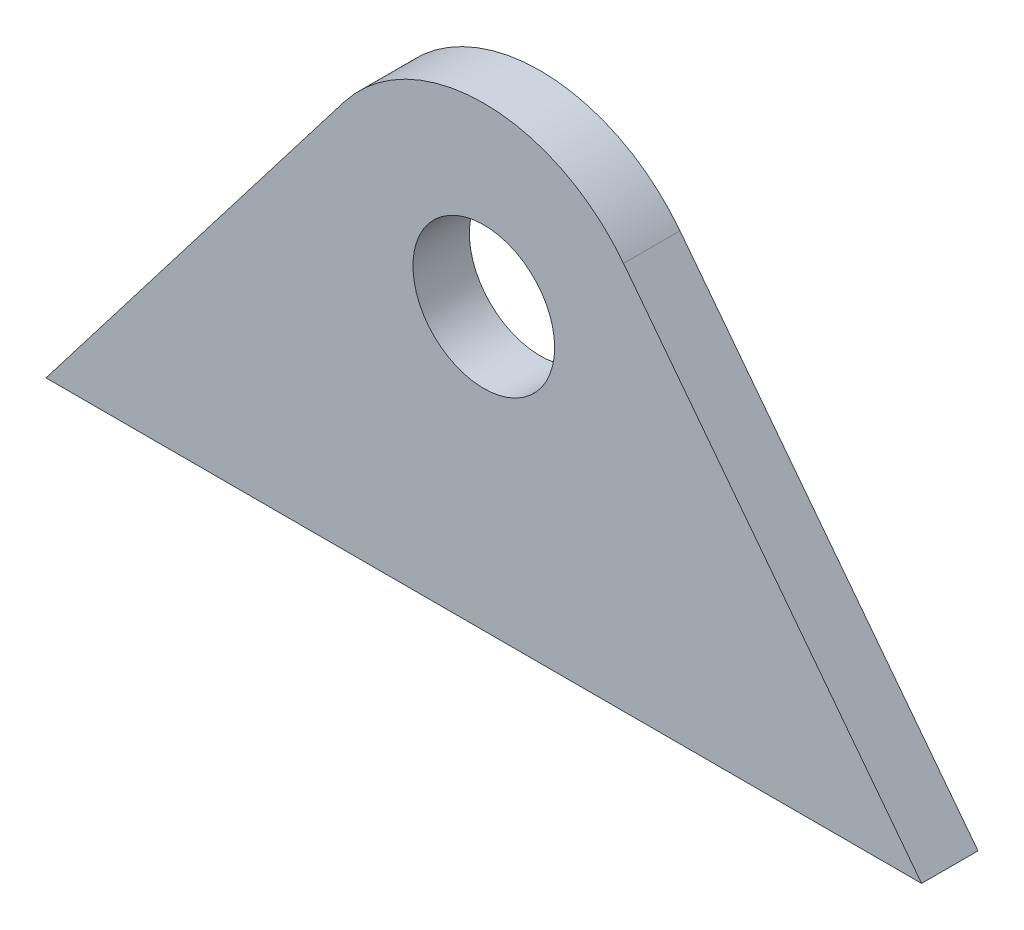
from build123d import *

# Parameters (mm, degrees)
ESQUISSE1_R      = 10.05
EXTRUSION1_DEPTH = 8


with BuildPart() as part:
    # Esquisse1 → Extrusion1 (new body)
    with BuildSketch(Plane.XY):
        with BuildLine():
            Line((-62.1, -39.8), (62.1, -39.8))
            Line((62.1, -39.8), (19.825377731, 15.230049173))
            ThreePointArc((19.825377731, 15.230049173), (0, 25), (-19.825377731, 15.230049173))
            Line((-19.825377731, 15.230049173), (-62.1, -39.8))
        make_face()
        Circle(ESQUISSE1_R, mode=Mode.SUBTRACT)
    extrude(amount=EXTRUSION1_DEPTH)


solid = part.part
